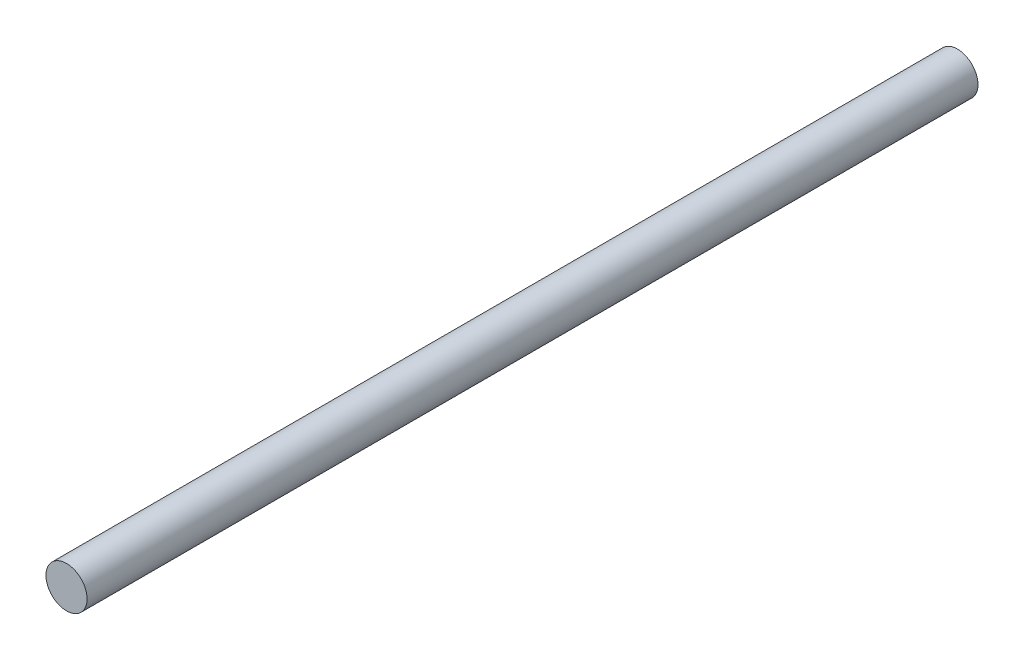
ISO-10303-21;
HEADER;
FILE_DESCRIPTION(('STEP AP214'),'2;1');
FILE_NAME('part.step','',(''),(''),'','','');
FILE_SCHEMA(('AUTOMOTIVE_DESIGN { 1 0 10303 214 1 1 1 1 }'));
ENDSEC;
DATA;
#1=APPLICATION_CONTEXT('core data for automotive mechanical design processes');
#2=APPLICATION_PROTOCOL_DEFINITION('international standard','automotive_design',2000,#1);
#3=PRODUCT_CONTEXT('',#1,'mechanical');
#4=PRODUCT('Part','Part','',(#3));
#5=PRODUCT_RELATED_PRODUCT_CATEGORY('part','',(#4));
#6=PRODUCT_DEFINITION_FORMATION('','',#4);
#7=PRODUCT_DEFINITION_CONTEXT('part definition',#1,'design');
#8=PRODUCT_DEFINITION('design','',#6,#7);
#9=PRODUCT_DEFINITION_SHAPE('','',#8);
#10=(LENGTH_UNIT() NAMED_UNIT(*) SI_UNIT(.MILLI.,.METRE.));
#11=(NAMED_UNIT(*) PLANE_ANGLE_UNIT() SI_UNIT($,.RADIAN.));
#12=(NAMED_UNIT(*) SI_UNIT($,.STERADIAN.) SOLID_ANGLE_UNIT());
#13=UNCERTAINTY_MEASURE_WITH_UNIT(LENGTH_MEASURE(1.E-05),#10,'distance_accuracy_value','');
#14=(GEOMETRIC_REPRESENTATION_CONTEXT(3) GLOBAL_UNCERTAINTY_ASSIGNED_CONTEXT((#13)) GLOBAL_UNIT_ASSIGNED_CONTEXT((#10,
#11,#12)) REPRESENTATION_CONTEXT('',''));
#15=CARTESIAN_POINT('',(0.,0.,0.));
#16=DIRECTION('',(0.,0.,1.));
#17=DIRECTION('',(1.,0.,0.));
#18=AXIS2_PLACEMENT_3D('',#15,#16,#17);
#19=CARTESIAN_POINT('',(0.,0.,130.));
#20=DIRECTION('',(0.,0.,-1.));
#21=DIRECTION('',(-1.,0.,0.));
#22=AXIS2_PLACEMENT_3D('',#19,#20,#21);
#23=CYLINDRICAL_SURFACE('',#22,3.);
#24=CARTESIAN_POINT('',(0.,0.,130.));
#25=DIRECTION('',(0.,0.,1.));
#26=DIRECTION('',(1.,0.,0.));
#27=AXIS2_PLACEMENT_3D('',#24,#25,#26);
#28=CIRCLE('',#27,3.);
#29=CARTESIAN_POINT('',(3.,0.,130.));
#30=VERTEX_POINT('',#29);
#31=EDGE_CURVE('E10',#30,#30,#28,.T.);
#32=ORIENTED_EDGE('',*,*,#31,.F.);
#33=EDGE_LOOP('',(#32));
#34=FACE_BOUND('',#33,.T.);
#35=CARTESIAN_POINT('',(0.,0.,0.));
#36=DIRECTION('',(0.,0.,1.));
#37=DIRECTION('',(1.,0.,0.));
#38=AXIS2_PLACEMENT_3D('',#35,#36,#37);
#39=CIRCLE('',#38,3.);
#40=CARTESIAN_POINT('',(3.,0.,0.));
#41=VERTEX_POINT('',#40);
#42=EDGE_CURVE('E38',#41,#41,#39,.T.);
#43=ORIENTED_EDGE('',*,*,#42,.T.);
#44=EDGE_LOOP('',(#43));
#45=FACE_BOUND('',#44,.T.);
#46=ADVANCED_FACE('F35',(#34,#45),#23,.T.);
#47=CARTESIAN_POINT('',(0.,0.,130.));
#48=DIRECTION('',(0.,0.,1.));
#49=DIRECTION('',(1.,0.,0.));
#50=AXIS2_PLACEMENT_3D('',#47,#48,#49);
#51=PLANE('',#50);
#52=ORIENTED_EDGE('',*,*,#31,.T.);
#53=EDGE_LOOP('',(#52));
#54=FACE_BOUND('',#53,.T.);
#55=ADVANCED_FACE('F50',(#54),#51,.T.);
#56=CARTESIAN_POINT('',(0.,0.,0.));
#57=DIRECTION('',(0.,0.,1.));
#58=DIRECTION('',(1.,0.,0.));
#59=AXIS2_PLACEMENT_3D('',#56,#57,#58);
#60=PLANE('',#59);
#61=ORIENTED_EDGE('',*,*,#42,.F.);
#62=EDGE_LOOP('',(#61));
#63=FACE_BOUND('',#62,.T.);
#64=ADVANCED_FACE('F48',(#63),#60,.F.);
#65=CLOSED_SHELL('',(#46,#55,#64));
#66=MANIFOLD_SOLID_BREP('B2',#65);
#67=ADVANCED_BREP_SHAPE_REPRESENTATION('',(#18,#66),#14);
#68=SHAPE_DEFINITION_REPRESENTATION(#9,#67);
ENDSEC;
END-ISO-10303-21;
